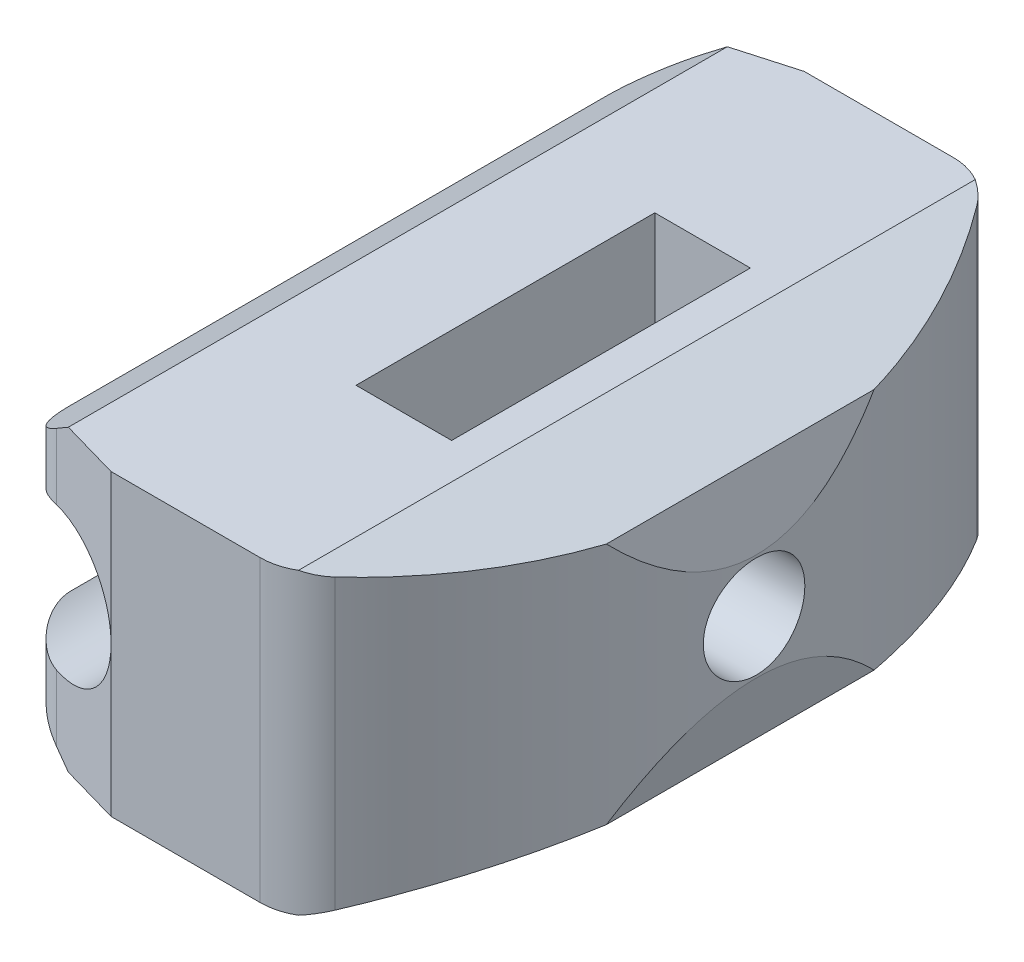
ISO-10303-21;
HEADER;
FILE_DESCRIPTION(('STEP AP214'),'2;1');
FILE_NAME('part.step','',(''),(''),'','','');
FILE_SCHEMA(('AUTOMOTIVE_DESIGN { 1 0 10303 214 1 1 1 1 }'));
ENDSEC;
DATA;
#1=APPLICATION_CONTEXT('core data for automotive mechanical design processes');
#2=APPLICATION_PROTOCOL_DEFINITION('international standard','automotive_design',2000,#1);
#3=PRODUCT_CONTEXT('',#1,'mechanical');
#4=PRODUCT('Part','Part','',(#3));
#5=PRODUCT_RELATED_PRODUCT_CATEGORY('part','',(#4));
#6=PRODUCT_DEFINITION_FORMATION('','',#4);
#7=PRODUCT_DEFINITION_CONTEXT('part definition',#1,'design');
#8=PRODUCT_DEFINITION('design','',#6,#7);
#9=PRODUCT_DEFINITION_SHAPE('','',#8);
#10=(LENGTH_UNIT() NAMED_UNIT(*) SI_UNIT(.MILLI.,.METRE.));
#11=(NAMED_UNIT(*) PLANE_ANGLE_UNIT() SI_UNIT($,.RADIAN.));
#12=(NAMED_UNIT(*) SI_UNIT($,.STERADIAN.) SOLID_ANGLE_UNIT());
#13=UNCERTAINTY_MEASURE_WITH_UNIT(LENGTH_MEASURE(1.E-05),#10,'distance_accuracy_value','');
#14=(GEOMETRIC_REPRESENTATION_CONTEXT(3) GLOBAL_UNCERTAINTY_ASSIGNED_CONTEXT((#13)) GLOBAL_UNIT_ASSIGNED_CONTEXT((#10,
#11,#12)) REPRESENTATION_CONTEXT('',''));
#15=CARTESIAN_POINT('',(0.,0.,0.));
#16=DIRECTION('',(0.,0.,1.));
#17=DIRECTION('',(1.,0.,0.));
#18=AXIS2_PLACEMENT_3D('',#15,#16,#17);
#19=CARTESIAN_POINT('',(5.,3.507651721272,-58.));
#20=DIRECTION('',(1.,0.,0.));
#21=DIRECTION('',(0.,0.,-1.));
#22=AXIS2_PLACEMENT_3D('',#19,#20,#21);
#23=PLANE('',#22);
#24=DIRECTION('',(0.,-1.,0.));
#25=VECTOR('',#24,1.);
#26=CARTESIAN_POINT('',(5.00000000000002,58.,-51.374386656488));
#27=LINE('',#26,#25);
#28=CARTESIAN_POINT('',(5.00000000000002,8.02786404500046,-51.374386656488));
#29=VERTEX_POINT('',#28);
#30=CARTESIAN_POINT('',(5.00000000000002,3.50765172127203,-51.374386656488));
#31=VERTEX_POINT('',#30);
#32=EDGE_CURVE('E802',#29,#31,#27,.T.);
#33=ORIENTED_EDGE('',*,*,#32,.T.);
#34=DIRECTION('',(0.,0.,1.));
#35=VECTOR('',#34,1.);
#36=CARTESIAN_POINT('',(5.,3.507651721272,-58.));
#37=LINE('',#36,#35);
#38=CARTESIAN_POINT('',(5.,3.50765172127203,-6.62561334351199));
#39=VERTEX_POINT('',#38);
#40=EDGE_CURVE('E283',#31,#39,#37,.T.);
#41=ORIENTED_EDGE('',*,*,#40,.T.);
#42=DIRECTION('',(0.,-1.,0.));
#43=VECTOR('',#42,1.);
#44=CARTESIAN_POINT('',(5.,58.,-6.62561334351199));
#45=LINE('',#44,#43);
#46=CARTESIAN_POINT('',(5.,8.02786404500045,-6.62561334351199));
#47=VERTEX_POINT('',#46);
#48=EDGE_CURVE('E798',#47,#39,#45,.T.);
#49=ORIENTED_EDGE('',*,*,#48,.F.);
#50=DIRECTION('',(0.,0.,1.));
#51=VECTOR('',#50,1.);
#52=CARTESIAN_POINT('',(5.,8.0278640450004,-58.));
#53=LINE('',#52,#51);
#54=EDGE_CURVE('E287',#29,#47,#53,.T.);
#55=ORIENTED_EDGE('',*,*,#54,.F.);
#56=EDGE_LOOP('',(#33,#41,#49,#55));
#57=FACE_BOUND('',#56,.T.);
#58=ADVANCED_FACE('F41',(#57),#23,.F.);
#59=CARTESIAN_POINT('',(5.,16.9721359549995,-58.));
#60=DIRECTION('',(1.,0.,0.));
#61=DIRECTION('',(0.,0.,-1.));
#62=AXIS2_PLACEMENT_3D('',#59,#60,#61);
#63=PLANE('',#62);
#64=DIRECTION('',(0.,-1.,0.));
#65=VECTOR('',#64,1.);
#66=CARTESIAN_POINT('',(5.00000000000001,58.,-51.374386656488));
#67=LINE('',#66,#65);
#68=CARTESIAN_POINT('',(5.00000000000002,16.9721359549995,-51.374386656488));
#69=VERTEX_POINT('',#68);
#70=CARTESIAN_POINT('',(5.00000000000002,21.492348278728,-51.374386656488));
#71=VERTEX_POINT('',#70);
#72=EDGE_CURVE('E309',#69,#71,#67,.F.);
#73=ORIENTED_EDGE('',*,*,#72,.F.);
#74=DIRECTION('',(0.,0.,1.));
#75=VECTOR('',#74,1.);
#76=CARTESIAN_POINT('',(4.99999999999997,16.9721359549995,-58.));
#77=LINE('',#76,#75);
#78=CARTESIAN_POINT('',(5.,16.9721359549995,-6.62561334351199));
#79=VERTEX_POINT('',#78);
#80=EDGE_CURVE('E291',#69,#79,#77,.T.);
#81=ORIENTED_EDGE('',*,*,#80,.T.);
#82=DIRECTION('',(0.,-1.,0.));
#83=VECTOR('',#82,1.);
#84=CARTESIAN_POINT('',(5.00000000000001,58.,-6.62561334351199));
#85=LINE('',#84,#83);
#86=CARTESIAN_POINT('',(5.,21.492348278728,-6.62561334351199));
#87=VERTEX_POINT('',#86);
#88=EDGE_CURVE('E220',#79,#87,#85,.F.);
#89=ORIENTED_EDGE('',*,*,#88,.T.);
#90=DIRECTION('',(0.,0.,1.));
#91=VECTOR('',#90,1.);
#92=CARTESIAN_POINT('',(5.,21.492348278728,-58.));
#93=LINE('',#92,#91);
#94=EDGE_CURVE('E248',#71,#87,#93,.T.);
#95=ORIENTED_EDGE('',*,*,#94,.F.);
#96=EDGE_LOOP('',(#73,#81,#89,#95));
#97=FACE_BOUND('',#96,.T.);
#98=ADVANCED_FACE('F503',(#97),#63,.F.);
#99=CARTESIAN_POINT('',(9.,12.5,-58.));
#100=DIRECTION('',(0.,0.,1.));
#101=DIRECTION('',(1.,0.,0.));
#102=AXIS2_PLACEMENT_3D('',#99,#100,#101);
#103=PLANE('',#102);
#104=DIRECTION('',(-1.,0.,0.));
#105=VECTOR('',#104,1.);
#106=CARTESIAN_POINT('',(30.,0.,-58.));
#107=LINE('',#106,#105);
#108=CARTESIAN_POINT('',(27.478285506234,0.,-58.));
#109=VERTEX_POINT('',#108);
#110=CARTESIAN_POINT('',(15.,0.,-58.));
#111=VERTEX_POINT('',#110);
#112=EDGE_CURVE('E229',#109,#111,#107,.T.);
#113=ORIENTED_EDGE('',*,*,#112,.T.);
#114=DIRECTION('',(0.,1.,0.));
#115=VECTOR('',#114,1.);
#116=CARTESIAN_POINT('',(15.,12.5,-58.));
#117=LINE('',#116,#115);
#118=CARTESIAN_POINT('',(15.,12.5,-58.));
#119=VERTEX_POINT('',#118);
#120=EDGE_CURVE('E208',#111,#119,#117,.T.);
#121=ORIENTED_EDGE('',*,*,#120,.T.);
#122=CARTESIAN_POINT('',(15.,25.,-58.));
#123=VERTEX_POINT('',#122);
#124=EDGE_CURVE('E221',#119,#123,#117,.T.);
#125=ORIENTED_EDGE('',*,*,#124,.T.);
#126=DIRECTION('',(1.,0.,0.));
#127=VECTOR('',#126,1.);
#128=CARTESIAN_POINT('',(10.,25.,-58.));
#129=LINE('',#128,#127);
#130=CARTESIAN_POINT('',(27.478285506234,25.,-58.));
#131=VERTEX_POINT('',#130);
#132=EDGE_CURVE('E242',#123,#131,#129,.T.);
#133=ORIENTED_EDGE('',*,*,#132,.T.);
#134=DIRECTION('',(0.,-1.,0.));
#135=VECTOR('',#134,1.);
#136=CARTESIAN_POINT('',(27.478285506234,58.,-58.));
#137=LINE('',#136,#135);
#138=EDGE_CURVE('E240',#109,#131,#137,.F.);
#139=ORIENTED_EDGE('',*,*,#138,.F.);
#140=EDGE_LOOP('',(#113,#121,#125,#133,#139));
#141=FACE_BOUND('',#140,.T.);
#142=ADVANCED_FACE('F238',(#141),#103,.F.);
#143=CARTESIAN_POINT('',(9.,12.5,0.));
#144=DIRECTION('',(0.,0.,1.));
#145=DIRECTION('',(1.,0.,0.));
#146=AXIS2_PLACEMENT_3D('',#143,#144,#145);
#147=PLANE('',#146);
#148=DIRECTION('',(0.,1.,0.));
#149=VECTOR('',#148,1.);
#150=CARTESIAN_POINT('',(15.,12.5,0.));
#151=LINE('',#150,#149);
#152=CARTESIAN_POINT('',(15.,0.,0.));
#153=VERTEX_POINT('',#152);
#154=CARTESIAN_POINT('',(15.,12.5,0.));
#155=VERTEX_POINT('',#154);
#156=EDGE_CURVE('E303',#153,#155,#151,.T.);
#157=ORIENTED_EDGE('',*,*,#156,.F.);
#158=DIRECTION('',(-1.,0.,0.));
#159=VECTOR('',#158,1.);
#160=CARTESIAN_POINT('',(30.,0.,0.));
#161=LINE('',#160,#159);
#162=CARTESIAN_POINT('',(27.478285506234,0.,0.));
#163=VERTEX_POINT('',#162);
#164=EDGE_CURVE('E252',#163,#153,#161,.T.);
#165=ORIENTED_EDGE('',*,*,#164,.F.);
#166=DIRECTION('',(0.,-1.,0.));
#167=VECTOR('',#166,1.);
#168=CARTESIAN_POINT('',(27.478285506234,58.,0.));
#169=LINE('',#168,#167);
#170=CARTESIAN_POINT('',(27.478285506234,25.,0.));
#171=VERTEX_POINT('',#170);
#172=EDGE_CURVE('E264',#163,#171,#169,.F.);
#173=ORIENTED_EDGE('',*,*,#172,.T.);
#174=DIRECTION('',(1.,0.,0.));
#175=VECTOR('',#174,1.);
#176=CARTESIAN_POINT('',(10.,25.,0.));
#177=LINE('',#176,#175);
#178=CARTESIAN_POINT('',(15.,25.,0.));
#179=VERTEX_POINT('',#178);
#180=EDGE_CURVE('E243',#179,#171,#177,.T.);
#181=ORIENTED_EDGE('',*,*,#180,.F.);
#182=EDGE_CURVE('E300',#155,#179,#151,.T.);
#183=ORIENTED_EDGE('',*,*,#182,.F.);
#184=EDGE_LOOP('',(#157,#165,#173,#181,#183));
#185=FACE_BOUND('',#184,.T.);
#186=ADVANCED_FACE('F533',(#185),#147,.T.);
#187=CARTESIAN_POINT('',(10.,25.,-58.));
#188=DIRECTION('',(0.,-1.,0.));
#189=DIRECTION('',(0.,0.,-1.));
#190=AXIS2_PLACEMENT_3D('',#187,#188,#189);
#191=PLANE('',#190);
#192=ORIENTED_EDGE('',*,*,#132,.F.);
#193=DIRECTION('',(-0.961644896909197,0.,0.274297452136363));
#194=VECTOR('',#193,1.);
#195=CARTESIAN_POINT('',(10.3761954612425,25.,-56.6811162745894));
#196=LINE('',#195,#194);
#197=CARTESIAN_POINT('',(10.,25.,-56.573811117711));
#198=VERTEX_POINT('',#197);
#199=EDGE_CURVE('E57',#123,#198,#196,.T.);
#200=ORIENTED_EDGE('',*,*,#199,.T.);
#201=DIRECTION('',(0.,0.,1.));
#202=VECTOR('',#201,1.);
#203=CARTESIAN_POINT('',(10.,25.,-58.));
#204=LINE('',#203,#202);
#205=CARTESIAN_POINT('',(10.,25.,-1.42618888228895));
#206=VERTEX_POINT('',#205);
#207=EDGE_CURVE('E261',#198,#206,#204,.T.);
#208=ORIENTED_EDGE('',*,*,#207,.T.);
#209=DIRECTION('',(0.961644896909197,0.,0.274297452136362));
#210=VECTOR('',#209,1.);
#211=CARTESIAN_POINT('',(-4.92285575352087,25.,-5.68275107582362));
#212=LINE('',#211,#210);
#213=EDGE_CURVE('E342',#206,#179,#212,.T.);
#214=ORIENTED_EDGE('',*,*,#213,.T.);
#215=ORIENTED_EDGE('',*,*,#180,.T.);
#216=CARTESIAN_POINT('',(27.478285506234,25.,-5.));
#217=DIRECTION('',(0.,-1.,0.));
#218=DIRECTION('',(0.,0.,-1.));
#219=AXIS2_PLACEMENT_3D('',#216,#217,#218);
#220=CIRCLE('',#219,5.00000000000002);
#221=CARTESIAN_POINT('',(30.,25.,-0.682482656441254));
#222=VERTEX_POINT('',#221);
#223=EDGE_CURVE('E65',#171,#222,#220,.F.);
#224=ORIENTED_EDGE('',*,*,#223,.T.);
#225=DIRECTION('',(0.,0.,1.));
#226=VECTOR('',#225,1.);
#227=CARTESIAN_POINT('',(30.,25.,-58.));
#228=LINE('',#227,#226);
#229=CARTESIAN_POINT('',(30.,25.,-57.3175173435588));
#230=VERTEX_POINT('',#229);
#231=EDGE_CURVE('E265',#230,#222,#228,.T.);
#232=ORIENTED_EDGE('',*,*,#231,.F.);
#233=CARTESIAN_POINT('',(27.478285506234,25.,-53.));
#234=DIRECTION('',(0.,-1.,0.));
#235=DIRECTION('',(0.,0.,-1.));
#236=AXIS2_PLACEMENT_3D('',#233,#234,#235);
#237=CIRCLE('',#236,5.00000000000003);
#238=EDGE_CURVE('E345',#230,#131,#237,.F.);
#239=ORIENTED_EDGE('',*,*,#238,.T.);
#240=EDGE_LOOP('',(#192,#200,#208,#214,#215,#224,#232,#239));
#241=FACE_BOUND('',#240,.T.);
#242=DIRECTION('',(-1.,0.,0.));
#243=VECTOR('',#242,1.);
#244=CARTESIAN_POINT('',(10.,25.,-41.5));
#245=LINE('',#244,#243);
#246=CARTESIAN_POINT('',(27.,25.,-41.5));
#247=VERTEX_POINT('',#246);
#248=CARTESIAN_POINT('',(19.,25.,-41.5));
#249=VERTEX_POINT('',#248);
#250=EDGE_CURVE('E255',#247,#249,#245,.T.);
#251=ORIENTED_EDGE('',*,*,#250,.F.);
#252=DIRECTION('',(0.,0.,-1.));
#253=VECTOR('',#252,1.);
#254=CARTESIAN_POINT('',(27.,25.,-58.));
#255=LINE('',#254,#253);
#256=CARTESIAN_POINT('',(27.,25.,-16.5));
#257=VERTEX_POINT('',#256);
#258=EDGE_CURVE('E462',#257,#247,#255,.T.);
#259=ORIENTED_EDGE('',*,*,#258,.F.);
#260=DIRECTION('',(1.,0.,0.));
#261=VECTOR('',#260,1.);
#262=CARTESIAN_POINT('',(10.,25.,-16.5));
#263=LINE('',#262,#261);
#264=CARTESIAN_POINT('',(19.,25.,-16.5));
#265=VERTEX_POINT('',#264);
#266=EDGE_CURVE('E465',#265,#257,#263,.T.);
#267=ORIENTED_EDGE('',*,*,#266,.F.);
#268=DIRECTION('',(0.,0.,1.));
#269=VECTOR('',#268,1.);
#270=CARTESIAN_POINT('',(19.,25.,-58.));
#271=LINE('',#270,#269);
#272=EDGE_CURVE('E468',#249,#265,#271,.T.);
#273=ORIENTED_EDGE('',*,*,#272,.F.);
#274=EDGE_LOOP('',(#251,#259,#267,#273));
#275=FACE_BOUND('',#274,.T.);
#276=ADVANCED_FACE('F485',(#241,#275),#191,.F.);
#277=CARTESIAN_POINT('',(30.,0.,-58.));
#278=DIRECTION('',(0.,1.,0.));
#279=DIRECTION('',(0.,0.,1.));
#280=AXIS2_PLACEMENT_3D('',#277,#278,#279);
#281=PLANE('',#280);
#282=DIRECTION('',(0.,0.,1.));
#283=VECTOR('',#282,1.);
#284=CARTESIAN_POINT('',(10.,0.,-58.));
#285=LINE('',#284,#283);
#286=CARTESIAN_POINT('',(10.,0.,-56.573811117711));
#287=VERTEX_POINT('',#286);
#288=CARTESIAN_POINT('',(10.,0.,-1.42618888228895));
#289=VERTEX_POINT('',#288);
#290=EDGE_CURVE('E232',#287,#289,#285,.T.);
#291=ORIENTED_EDGE('',*,*,#290,.F.);
#292=DIRECTION('',(-0.961644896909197,0.,0.274297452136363));
#293=VECTOR('',#292,1.);
#294=CARTESIAN_POINT('',(15.,0.,-58.));
#295=LINE('',#294,#293);
#296=EDGE_CURVE('E212',#111,#287,#295,.T.);
#297=ORIENTED_EDGE('',*,*,#296,.F.);
#298=ORIENTED_EDGE('',*,*,#112,.F.);
#299=CARTESIAN_POINT('',(27.478285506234,0.,-53.));
#300=DIRECTION('',(0.,1.,0.));
#301=DIRECTION('',(0.,0.,1.));
#302=AXIS2_PLACEMENT_3D('',#299,#300,#301);
#303=CIRCLE('',#302,5.00000000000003);
#304=CARTESIAN_POINT('',(30.,0.,-57.3175173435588));
#305=VERTEX_POINT('',#304);
#306=EDGE_CURVE('E337',#305,#109,#303,.T.);
#307=ORIENTED_EDGE('',*,*,#306,.F.);
#308=DIRECTION('',(0.,0.,1.));
#309=VECTOR('',#308,1.);
#310=CARTESIAN_POINT('',(30.,0.,-58.));
#311=LINE('',#310,#309);
#312=CARTESIAN_POINT('',(30.,0.,-0.682482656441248));
#313=VERTEX_POINT('',#312);
#314=EDGE_CURVE('E277',#305,#313,#311,.T.);
#315=ORIENTED_EDGE('',*,*,#314,.T.);
#316=CARTESIAN_POINT('',(27.478285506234,0.,-5.));
#317=DIRECTION('',(0.,1.,0.));
#318=DIRECTION('',(0.,0.,1.));
#319=AXIS2_PLACEMENT_3D('',#316,#317,#318);
#320=CIRCLE('',#319,5.00000000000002);
#321=EDGE_CURVE('E847',#163,#313,#320,.T.);
#322=ORIENTED_EDGE('',*,*,#321,.F.);
#323=ORIENTED_EDGE('',*,*,#164,.T.);
#324=DIRECTION('',(0.961644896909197,0.,0.274297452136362));
#325=VECTOR('',#324,1.);
#326=CARTESIAN_POINT('',(15.,0.,0.));
#327=LINE('',#326,#325);
#328=EDGE_CURVE('E234',#289,#153,#327,.T.);
#329=ORIENTED_EDGE('',*,*,#328,.F.);
#330=EDGE_LOOP('',(#291,#297,#298,#307,#315,#322,#323,#329));
#331=FACE_BOUND('',#330,.T.);
#332=DIRECTION('',(-1.,0.,0.));
#333=VECTOR('',#332,1.);
#334=CARTESIAN_POINT('',(27.,0.,-41.5));
#335=LINE('',#334,#333);
#336=CARTESIAN_POINT('',(27.,0.,-41.5));
#337=VERTEX_POINT('',#336);
#338=CARTESIAN_POINT('',(19.,0.,-41.5));
#339=VERTEX_POINT('',#338);
#340=EDGE_CURVE('E433',#337,#339,#335,.T.);
#341=ORIENTED_EDGE('',*,*,#340,.T.);
#342=DIRECTION('',(0.,0.,1.));
#343=VECTOR('',#342,1.);
#344=CARTESIAN_POINT('',(19.,0.,-41.5));
#345=LINE('',#344,#343);
#346=CARTESIAN_POINT('',(19.,0.,-16.5));
#347=VERTEX_POINT('',#346);
#348=EDGE_CURVE('E437',#339,#347,#345,.T.);
#349=ORIENTED_EDGE('',*,*,#348,.T.);
#350=DIRECTION('',(1.,0.,0.));
#351=VECTOR('',#350,1.);
#352=CARTESIAN_POINT('',(19.,0.,-16.5));
#353=LINE('',#352,#351);
#354=CARTESIAN_POINT('',(27.,0.,-16.5));
#355=VERTEX_POINT('',#354);
#356=EDGE_CURVE('E441',#347,#355,#353,.T.);
#357=ORIENTED_EDGE('',*,*,#356,.T.);
#358=DIRECTION('',(0.,0.,-1.));
#359=VECTOR('',#358,1.);
#360=CARTESIAN_POINT('',(27.,0.,-16.5));
#361=LINE('',#360,#359);
#362=EDGE_CURVE('E445',#355,#337,#361,.T.);
#363=ORIENTED_EDGE('',*,*,#362,.T.);
#364=EDGE_LOOP('',(#341,#349,#357,#363));
#365=FACE_BOUND('',#364,.T.);
#366=ADVANCED_FACE('F226',(#331,#365),#281,.F.);
#367=CARTESIAN_POINT('',(10.,25.,-58.));
#368=DIRECTION('',(-0.574302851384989,0.81864292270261,0.));
#369=DIRECTION('',(-0.81864292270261,-0.574302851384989,0.));
#370=AXIS2_PLACEMENT_3D('',#367,#368,#369);
#371=PLANE('',#370);
#372=DIRECTION('',(0.797197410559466,0.559258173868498,-0.227390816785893));
#373=VECTOR('',#372,1.);
#374=CARTESIAN_POINT('',(10.2585329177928,25.1813686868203,-56.6475544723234));
#375=LINE('',#374,#373);
#376=CARTESIAN_POINT('',(8.62851273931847,24.0378600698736,-56.182611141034));
#377=VERTEX_POINT('',#376);
#378=EDGE_CURVE('E361',#377,#198,#375,.T.);
#379=ORIENTED_EDGE('',*,*,#378,.F.);
#380=CARTESIAN_POINT('',(10.,25.,-51.374386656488));
#381=DIRECTION('',(-0.574302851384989,0.81864292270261,0.));
#382=DIRECTION('',(-0.81864292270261,-0.574302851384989,0.));
#383=AXIS2_PLACEMENT_3D('',#380,#381,#382);
#384=ELLIPSE('',#383,6.107668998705,4.99999999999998);
#385=EDGE_CURVE('E421',#71,#377,#384,.F.);
#386=ORIENTED_EDGE('',*,*,#385,.F.);
#387=ORIENTED_EDGE('',*,*,#94,.T.);
#388=CARTESIAN_POINT('',(10.,25.,-6.62561334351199));
#389=DIRECTION('',(-0.574302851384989,0.81864292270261,0.));
#390=DIRECTION('',(-0.81864292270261,-0.574302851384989,0.));
#391=AXIS2_PLACEMENT_3D('',#388,#389,#390);
#392=ELLIPSE('',#391,6.10766899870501,4.99999999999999);
#393=CARTESIAN_POINT('',(8.62851273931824,24.0378600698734,-1.817388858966));
#394=VERTEX_POINT('',#393);
#395=EDGE_CURVE('E779',#394,#87,#392,.F.);
#396=ORIENTED_EDGE('',*,*,#395,.F.);
#397=DIRECTION('',(-0.797197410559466,-0.559258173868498,-0.227390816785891));
#398=VECTOR('',#397,1.);
#399=CARTESIAN_POINT('',(-0.255438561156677,17.8054986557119,-4.35142737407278));
#400=LINE('',#399,#398);
#401=EDGE_CURVE('E349',#206,#394,#400,.T.);
#402=ORIENTED_EDGE('',*,*,#401,.F.);
#403=ORIENTED_EDGE('',*,*,#207,.F.);
#404=EDGE_LOOP('',(#379,#386,#387,#396,#402,#403));
#405=FACE_BOUND('',#404,.T.);
#406=ADVANCED_FACE('F43',(#405),#371,.T.);
#407=CARTESIAN_POINT('',(30.,25.,-58.));
#408=DIRECTION('',(-0.260224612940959,-0.965548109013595,0.));
#409=DIRECTION('',(0.965548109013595,-0.260224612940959,0.));
#410=AXIS2_PLACEMENT_3D('',#407,#408,#409);
#411=PLANE('',#410);
#412=ORIENTED_EDGE('',*,*,#231,.T.);
#413=CARTESIAN_POINT('',(27.478285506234,25.6796265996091,-5.));
#414=DIRECTION('',(-0.260224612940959,-0.965548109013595,0.));
#415=DIRECTION('',(0.965548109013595,-0.260224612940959,0.));
#416=AXIS2_PLACEMENT_3D('',#413,#414,#415);
#417=ELLIPSE('',#416,5.17840587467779,5.00000000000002);
#418=CARTESIAN_POINT('',(31.5839080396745,24.5731213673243,-2.14625445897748));
#419=VERTEX_POINT('',#418);
#420=EDGE_CURVE('E816',#222,#419,#417,.F.);
#421=ORIENTED_EDGE('',*,*,#420,.T.);
#422=CARTESIAN_POINT('',(-7.05000000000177,34.9853356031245,-29.));
#423=DIRECTION('',(-0.260224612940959,-0.965548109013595,0.));
#424=DIRECTION('',(0.965548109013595,-0.260224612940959,0.));
#425=AXIS2_PLACEMENT_3D('',#422,#423,#424);
#426=ELLIPSE('',#425,48.7287992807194,47.0500000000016);
#427=CARTESIAN_POINT('',(38.6475566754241,22.6693993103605,-17.8001868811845));
#428=VERTEX_POINT('',#427);
#429=EDGE_CURVE('E427',#419,#428,#426,.F.);
#430=ORIENTED_EDGE('',*,*,#429,.T.);
#431=DIRECTION('',(0.,0.,1.));
#432=VECTOR('',#431,1.);
#433=CARTESIAN_POINT('',(38.6475566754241,22.6693993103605,-58.));
#434=LINE('',#433,#432);
#435=CARTESIAN_POINT('',(38.6475566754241,22.6693993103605,-40.1998131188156));
#436=VERTEX_POINT('',#435);
#437=EDGE_CURVE('E269',#436,#428,#434,.T.);
#438=ORIENTED_EDGE('',*,*,#437,.F.);
#439=CARTESIAN_POINT('',(31.5839080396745,24.5731213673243,-55.8537455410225));
#440=VERTEX_POINT('',#439);
#441=EDGE_CURVE('E428',#436,#440,#426,.F.);
#442=ORIENTED_EDGE('',*,*,#441,.T.);
#443=CARTESIAN_POINT('',(27.478285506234,25.6796265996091,-53.));
#444=DIRECTION('',(-0.260224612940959,-0.965548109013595,0.));
#445=DIRECTION('',(0.965548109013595,-0.260224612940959,0.));
#446=AXIS2_PLACEMENT_3D('',#443,#444,#445);
#447=ELLIPSE('',#446,5.17840587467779,5.00000000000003);
#448=EDGE_CURVE('E334',#440,#230,#447,.F.);
#449=ORIENTED_EDGE('',*,*,#448,.T.);
#450=EDGE_LOOP('',(#412,#421,#430,#438,#442,#449));
#451=FACE_BOUND('',#450,.T.);
#452=ADVANCED_FACE('F526',(#451),#411,.F.);
#453=CARTESIAN_POINT('',(39.9999999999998,16.9575563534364,-58.));
#454=DIRECTION('',(0.973094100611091,0.230408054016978,0.));
#455=DIRECTION('',(-0.230408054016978,0.973094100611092,0.));
#456=AXIS2_PLACEMENT_3D('',#453,#454,#455);
#457=PLANE('',#456);
#458=ORIENTED_EDGE('',*,*,#437,.T.);
#459=CARTESIAN_POINT('',(-7.05000000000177,215.66622402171,-29.));
#460=DIRECTION('',(0.973094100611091,0.230408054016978,0.));
#461=DIRECTION('',(0.230408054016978,-0.973094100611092,0.));
#462=AXIS2_PLACEMENT_3D('',#459,#460,#461);
#463=ELLIPSE('',#462,204.202931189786,47.0500000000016);
#464=EDGE_CURVE('E424',#436,#428,#463,.F.);
#465=ORIENTED_EDGE('',*,*,#464,.F.);
#466=EDGE_LOOP('',(#458,#465));
#467=FACE_BOUND('',#466,.T.);
#468=ADVANCED_FACE('F522',(#467),#457,.T.);
#469=CARTESIAN_POINT('',(39.9999999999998,8.04244364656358,-58.));
#470=DIRECTION('',(-0.973094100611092,0.230408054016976,0.));
#471=DIRECTION('',(-0.230408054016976,-0.973094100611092,0.));
#472=AXIS2_PLACEMENT_3D('',#469,#470,#471);
#473=PLANE('',#472);
#474=DIRECTION('',(0.,0.,1.));
#475=VECTOR('',#474,1.);
#476=CARTESIAN_POINT('',(38.6475566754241,2.33060068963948,-58.));
#477=LINE('',#476,#475);
#478=CARTESIAN_POINT('',(38.6475566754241,2.33060068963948,-40.1998131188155));
#479=VERTEX_POINT('',#478);
#480=CARTESIAN_POINT('',(38.6475566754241,2.33060068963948,-17.8001868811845));
#481=VERTEX_POINT('',#480);
#482=EDGE_CURVE('E273',#479,#481,#477,.T.);
#483=ORIENTED_EDGE('',*,*,#482,.F.);
#484=CARTESIAN_POINT('',(-7.05000000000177,-190.666224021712,-29.));
#485=DIRECTION('',(-0.973094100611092,0.230408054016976,0.));
#486=DIRECTION('',(-0.230408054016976,-0.973094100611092,0.));
#487=AXIS2_PLACEMENT_3D('',#484,#485,#486);
#488=ELLIPSE('',#487,204.202931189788,47.0500000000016);
#489=EDGE_CURVE('E326',#479,#481,#488,.F.);
#490=ORIENTED_EDGE('',*,*,#489,.T.);
#491=EDGE_LOOP('',(#483,#490));
#492=FACE_BOUND('',#491,.T.);
#493=ADVANCED_FACE('F519',(#492),#473,.F.);
#494=CARTESIAN_POINT('',(30.,0.,-58.));
#495=DIRECTION('',(0.260224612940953,-0.965548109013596,0.));
#496=DIRECTION('',(0.965548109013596,0.260224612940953,0.));
#497=AXIS2_PLACEMENT_3D('',#494,#495,#496);
#498=PLANE('',#497);
#499=CARTESIAN_POINT('',(27.478285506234,-0.679626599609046,-5.));
#500=DIRECTION('',(0.260224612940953,-0.965548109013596,0.));
#501=DIRECTION('',(-0.965548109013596,-0.260224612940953,0.));
#502=AXIS2_PLACEMENT_3D('',#499,#500,#501);
#503=ELLIPSE('',#502,5.17840587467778,5.00000000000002);
#504=CARTESIAN_POINT('',(31.5839080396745,0.426878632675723,-2.14625445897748));
#505=VERTEX_POINT('',#504);
#506=EDGE_CURVE('E774',#313,#505,#503,.F.);
#507=ORIENTED_EDGE('',*,*,#506,.F.);
#508=ORIENTED_EDGE('',*,*,#314,.F.);
#509=CARTESIAN_POINT('',(27.478285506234,-0.679626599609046,-53.));
#510=DIRECTION('',(0.260224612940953,-0.965548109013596,0.));
#511=DIRECTION('',(-0.965548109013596,-0.260224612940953,0.));
#512=AXIS2_PLACEMENT_3D('',#509,#510,#511);
#513=ELLIPSE('',#512,5.17840587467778,5.00000000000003);
#514=CARTESIAN_POINT('',(31.5839080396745,0.426878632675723,-55.8537455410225));
#515=VERTEX_POINT('',#514);
#516=EDGE_CURVE('E332',#515,#305,#513,.F.);
#517=ORIENTED_EDGE('',*,*,#516,.F.);
#518=CARTESIAN_POINT('',(-7.05000000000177,-9.98533560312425,-29.));
#519=DIRECTION('',(0.260224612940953,-0.965548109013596,0.));
#520=DIRECTION('',(-0.965548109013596,-0.260224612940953,0.));
#521=AXIS2_PLACEMENT_3D('',#518,#519,#520);
#522=ELLIPSE('',#521,48.7287992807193,47.0500000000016);
#523=EDGE_CURVE('E45',#479,#515,#522,.F.);
#524=ORIENTED_EDGE('',*,*,#523,.F.);
#525=ORIENTED_EDGE('',*,*,#482,.T.);
#526=EDGE_CURVE('E12',#505,#481,#522,.F.);
#527=ORIENTED_EDGE('',*,*,#526,.F.);
#528=EDGE_LOOP('',(#507,#508,#517,#524,#525,#527));
#529=FACE_BOUND('',#528,.T.);
#530=ADVANCED_FACE('F341',(#529),#498,.T.);
#531=CARTESIAN_POINT('',(10.,0.,-58.));
#532=DIRECTION('',(0.57430285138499,0.81864292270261,0.));
#533=DIRECTION('',(-0.818642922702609,0.574302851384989,0.));
#534=AXIS2_PLACEMENT_3D('',#531,#532,#533);
#535=PLANE('',#534);
#536=CARTESIAN_POINT('',(10.,0.,-51.374386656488));
#537=DIRECTION('',(0.57430285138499,0.81864292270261,0.));
#538=DIRECTION('',(0.818642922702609,-0.574302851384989,0.));
#539=AXIS2_PLACEMENT_3D('',#536,#537,#538);
#540=ELLIPSE('',#539,6.107668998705,4.99999999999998);
#541=CARTESIAN_POINT('',(8.62851273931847,0.962139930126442,-56.182611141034));
#542=VERTEX_POINT('',#541);
#543=EDGE_CURVE('E417',#31,#542,#540,.F.);
#544=ORIENTED_EDGE('',*,*,#543,.T.);
#545=DIRECTION('',(0.797197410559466,-0.559258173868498,-0.227390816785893));
#546=VECTOR('',#545,1.);
#547=CARTESIAN_POINT('',(10.2585329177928,-0.181368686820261,-56.6475544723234));
#548=LINE('',#547,#546);
#549=EDGE_CURVE('E358',#542,#287,#548,.T.);
#550=ORIENTED_EDGE('',*,*,#549,.T.);
#551=ORIENTED_EDGE('',*,*,#290,.T.);
#552=DIRECTION('',(-0.797197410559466,0.559258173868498,-0.227390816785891));
#553=VECTOR('',#552,1.);
#554=CARTESIAN_POINT('',(-0.255438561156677,7.19450134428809,-4.35142737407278));
#555=LINE('',#554,#553);
#556=CARTESIAN_POINT('',(8.62851273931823,0.96213993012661,-1.817388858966));
#557=VERTEX_POINT('',#556);
#558=EDGE_CURVE('E824',#289,#557,#555,.T.);
#559=ORIENTED_EDGE('',*,*,#558,.T.);
#560=CARTESIAN_POINT('',(10.,0.,-6.62561334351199));
#561=DIRECTION('',(0.57430285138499,0.81864292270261,0.));
#562=DIRECTION('',(0.818642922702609,-0.574302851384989,0.));
#563=AXIS2_PLACEMENT_3D('',#560,#561,#562);
#564=ELLIPSE('',#563,6.10766899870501,4.99999999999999);
#565=EDGE_CURVE('E782',#557,#39,#564,.F.);
#566=ORIENTED_EDGE('',*,*,#565,.T.);
#567=ORIENTED_EDGE('',*,*,#40,.F.);
#568=EDGE_LOOP('',(#544,#550,#551,#559,#566,#567));
#569=FACE_BOUND('',#568,.T.);
#570=ADVANCED_FACE('F511',(#569),#535,.F.);
#571=CARTESIAN_POINT('',(9.,12.5,-58.));
#572=DIRECTION('',(0.,0.,1.));
#573=DIRECTION('',(1.,0.,0.));
#574=AXIS2_PLACEMENT_3D('',#571,#572,#573);
#575=CYLINDRICAL_SURFACE('',#574,5.99999999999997);
#576=CARTESIAN_POINT('',(9.,12.5,-56.2885733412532));
#577=DIRECTION('',(0.274297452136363,0.,0.961644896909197));
#578=DIRECTION('',(-0.961644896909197,0.,0.274297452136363));
#579=AXIS2_PLACEMENT_3D('',#576,#577,#578);
#580=ELLIPSE('',#579,6.23930935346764,5.99999999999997);
#581=CARTESIAN_POINT('',(8.62851273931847,6.51151127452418,-56.182611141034));
#582=VERTEX_POINT('',#581);
#583=EDGE_CURVE('E215',#119,#582,#580,.F.);
#584=ORIENTED_EDGE('',*,*,#583,.T.);
#585=CARTESIAN_POINT('',(8.62851273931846,6.51151127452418,-56.1826111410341));
#586=CARTESIAN_POINT('',(8.50232624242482,6.51931361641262,-56.1466442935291));
#587=CARTESIAN_POINT('',(8.37785560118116,6.53106276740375,-56.1057446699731));
#588=CARTESIAN_POINT('',(8.13339300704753,6.56164452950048,-56.0147208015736));
#589=CARTESIAN_POINT('',(8.01339591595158,6.58046872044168,-55.9646075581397));
#590=CARTESIAN_POINT('',(7.77958224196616,6.62423326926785,-55.8561538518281));
#591=CARTESIAN_POINT('',(7.66572319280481,6.64912243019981,-55.7978839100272));
#592=CARTESIAN_POINT('',(7.44375800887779,6.7042084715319,-55.6734363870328));
#593=CARTESIAN_POINT('',(7.33565348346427,6.73440682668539,-55.6072566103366));
#594=CARTESIAN_POINT('',(7.0217416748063,6.83129478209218,-55.3984250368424));
#595=CARTESIAN_POINT('',(6.82506611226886,6.90453248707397,-55.244883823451));
#596=CARTESIAN_POINT('',(6.45830826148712,7.06127323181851,-54.9124616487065));
#597=CARTESIAN_POINT('',(6.28830532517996,7.14480562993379,-54.7335079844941));
#598=CARTESIAN_POINT('',(6.04416774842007,7.27762460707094,-54.435570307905));
#599=CARTESIAN_POINT('',(5.96033293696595,7.3261249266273,-54.3240547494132));
#600=CARTESIAN_POINT('',(5.80212873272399,7.42238173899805,-54.0941949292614));
#601=CARTESIAN_POINT('',(5.72776100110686,7.47013809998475,-53.9758494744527));
#602=CARTESIAN_POINT('',(5.51950076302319,7.60981302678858,-53.6112169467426));
#603=CARTESIAN_POINT('',(5.40013169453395,7.698321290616,-53.3549445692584));
#604=CARTESIAN_POINT('',(5.22641201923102,7.83421840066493,-52.8784142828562));
#605=CARTESIAN_POINT('',(5.16353110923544,7.88637035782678,-52.6626596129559));
#606=CARTESIAN_POINT('',(5.09116335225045,7.94786136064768,-52.3315087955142));
#607=CARTESIAN_POINT('',(5.07070980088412,7.9655589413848,-52.2199942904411));
#608=CARTESIAN_POINT('',(5.0373725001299,7.99466036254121,-51.9950546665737));
#609=CARTESIAN_POINT('',(5.02448420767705,8.00606797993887,-51.8816307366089));
#610=CARTESIAN_POINT('',(5.01033830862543,8.01863373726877,-51.70237226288));
#611=CARTESIAN_POINT('',(5.00646443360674,8.02208836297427,-51.6368877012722));
#612=CARTESIAN_POINT('',(5.00129442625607,8.02670604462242,-51.5057345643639));
#613=CARTESIAN_POINT('',(4.99999837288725,8.02786903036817,-51.4400659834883));
#614=CARTESIAN_POINT('',(5.00000000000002,8.02786404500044,-51.374386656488));
#615=B_SPLINE_CURVE_WITH_KNOTS('',3,(#585,#586,#587,#588,#589,#590,#591,#592,#593,#594,#595,
#596,#597,#598,#599,#600,#601,#602,#603,#604,#605,#606,#607,#608,#609,#610,#611,#612,#613,#614),
.UNSPECIFIED.,.F.,.F.,(4,2,2,2,2,2,2,2,2,2,2,2,2,2,4),(0.,0.394078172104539,0.787688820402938,
1.1780854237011,1.56859064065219,2.34537424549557,3.12442669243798,3.56710721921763,
4.00986531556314,4.89379095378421,5.58299016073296,5.92686115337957,6.27052543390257,
6.46751359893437,6.6645077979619),.UNSPECIFIED.);
#616=EDGE_CURVE('E410',#582,#29,#615,.T.);
#617=ORIENTED_EDGE('',*,*,#616,.T.);
#618=ORIENTED_EDGE('',*,*,#54,.T.);
#619=CARTESIAN_POINT('',(5.00000000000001,8.02786404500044,-6.62561334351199));
#620=CARTESIAN_POINT('',(4.99996630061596,8.0279448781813,-6.50117211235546));
#621=CARTESIAN_POINT('',(5.00464389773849,8.0237108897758,-6.37677762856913));
#622=CARTESIAN_POINT('',(5.02315055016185,8.00723462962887,-6.12938748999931));
#623=CARTESIAN_POINT('',(5.03696578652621,7.99500445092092,-6.00639000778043));
#624=CARTESIAN_POINT('',(5.07328898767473,7.96331865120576,-5.76397870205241));
#625=CARTESIAN_POINT('',(5.09570544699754,7.94393917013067,-5.64454095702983));
#626=CARTESIAN_POINT('',(5.14884022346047,7.89893638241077,-5.40870692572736));
#627=CARTESIAN_POINT('',(5.17956135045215,7.87331096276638,-5.29231168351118));
#628=CARTESIAN_POINT('',(5.24867779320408,7.81710055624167,-5.06385117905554));
#629=CARTESIAN_POINT('',(5.28702727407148,7.78654538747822,-4.95176461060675));
#630=CARTESIAN_POINT('',(5.3711067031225,7.721510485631,-4.7316140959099));
#631=CARTESIAN_POINT('',(5.4168361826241,7.68703100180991,-4.62354989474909));
#632=CARTESIAN_POINT('',(5.56489915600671,7.57912686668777,-4.30509449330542));
#633=CARTESIAN_POINT('',(5.67792157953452,7.50139622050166,-4.10104534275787));
#634=CARTESIAN_POINT('',(5.95122039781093,7.3293966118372,-3.67932888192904));
#635=CARTESIAN_POINT('',(6.1162191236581,7.23451730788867,-3.46498314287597));
#636=CARTESIAN_POINT('',(6.48009527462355,7.05099801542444,-3.06423197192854));
#637=CARTESIAN_POINT('',(6.6789560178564,6.96235498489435,-2.87781286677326));
#638=CARTESIAN_POINT('',(7.08324464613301,6.81081021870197,-2.5573436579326));
#639=CARTESIAN_POINT('',(7.28510997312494,6.74610360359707,-2.41970681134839));
#640=CARTESIAN_POINT('',(7.60396769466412,6.66363425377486,-2.23538495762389));
#641=CARTESIAN_POINT('',(7.71283374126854,6.63859090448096,-2.17767178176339));
#642=CARTESIAN_POINT('',(7.93544710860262,6.59410621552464,-2.07008110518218));
#643=CARTESIAN_POINT('',(8.04919156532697,6.57466163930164,-2.02019908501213));
#644=CARTESIAN_POINT('',(8.24064874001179,6.54775464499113,-1.94466258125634));
#645=CARTESIAN_POINT('',(8.31717171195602,6.53847561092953,-1.91660663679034));
#646=CARTESIAN_POINT('',(8.47174810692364,6.52279393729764,-1.86419429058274));
#647=CARTESIAN_POINT('',(8.54980127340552,6.51639081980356,-1.8398372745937));
#648=CARTESIAN_POINT('',(8.62851273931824,6.51151127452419,-1.817388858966));
#649=B_SPLINE_CURVE_WITH_KNOTS('',3,(#619,#620,#621,#622,#623,#624,#625,#626,#627,#628,#629,
#630,#631,#632,#633,#634,#635,#636,#637,#638,#639,#640,#641,#642,#643,#644,#645,#646,#647,#648),
.UNSPECIFIED.,.F.,.F.,(4,2,2,2,2,2,2,2,2,2,2,2,2,2,4),(0.,0.373089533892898,0.745616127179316,
1.11428475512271,1.4830782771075,1.84971942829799,2.21633730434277,2.95151187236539,
3.80817249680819,4.6644123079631,5.41931694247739,5.79614758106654,6.17275994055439,
6.41871499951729,6.6646291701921),.UNSPECIFIED.);
#650=CARTESIAN_POINT('',(8.62851273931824,6.51151127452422,-1.817388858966));
#651=VERTEX_POINT('',#650);
#652=EDGE_CURVE('E375',#47,#651,#649,.T.);
#653=ORIENTED_EDGE('',*,*,#652,.T.);
#654=CARTESIAN_POINT('',(9.,12.5,-1.71142665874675));
#655=DIRECTION('',(0.274297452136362,0.,-0.961644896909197));
#656=DIRECTION('',(0.961644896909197,0.,0.274297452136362));
#657=AXIS2_PLACEMENT_3D('',#654,#655,#656);
#658=ELLIPSE('',#657,6.23930935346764,5.99999999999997);
#659=EDGE_CURVE('E794',#651,#155,#658,.F.);
#660=ORIENTED_EDGE('',*,*,#659,.T.);
#661=CARTESIAN_POINT('',(8.62851273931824,18.4884887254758,-1.817388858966));
#662=VERTEX_POINT('',#661);
#663=EDGE_CURVE('E823',#155,#662,#658,.F.);
#664=ORIENTED_EDGE('',*,*,#663,.T.);
#665=CARTESIAN_POINT('',(8.62851273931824,18.4884887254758,-1.817388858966));
#666=CARTESIAN_POINT('',(8.5023262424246,18.4806863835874,-1.85335570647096));
#667=CARTESIAN_POINT('',(8.37785560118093,18.4689372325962,-1.89425533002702));
#668=CARTESIAN_POINT('',(8.1333930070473,18.4383554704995,-1.98527919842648));
#669=CARTESIAN_POINT('',(8.01339591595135,18.4195312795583,-2.03539244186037));
#670=CARTESIAN_POINT('',(7.77958224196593,18.3757667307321,-2.14384614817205));
#671=CARTESIAN_POINT('',(7.66572319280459,18.3508775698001,-2.20211608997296));
#672=CARTESIAN_POINT('',(7.44375800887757,18.295791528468,-2.32656361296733));
#673=CARTESIAN_POINT('',(7.33565348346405,18.2655931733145,-2.39274338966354));
#674=CARTESIAN_POINT('',(7.02174167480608,18.1687052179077,-2.60157496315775));
#675=CARTESIAN_POINT('',(6.82506611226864,18.0954675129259,-2.75511617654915));
#676=CARTESIAN_POINT('',(6.45830826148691,17.9387267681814,-3.08753835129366));
#677=CARTESIAN_POINT('',(6.28830532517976,17.8551943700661,-3.26649201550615));
#678=CARTESIAN_POINT('',(6.04416774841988,17.722375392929,-3.56442969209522));
#679=CARTESIAN_POINT('',(5.96033293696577,17.6738750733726,-3.67594525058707));
#680=CARTESIAN_POINT('',(5.80212873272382,17.5776182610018,-3.90580507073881));
#681=CARTESIAN_POINT('',(5.72776100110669,17.5298619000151,-4.0241505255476));
#682=CARTESIAN_POINT('',(5.51950076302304,17.3901869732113,-4.3887830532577));
#683=CARTESIAN_POINT('',(5.40013169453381,17.3016787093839,-4.64505543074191));
#684=CARTESIAN_POINT('',(5.22641201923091,17.165781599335,-5.12158571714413));
#685=CARTESIAN_POINT('',(5.16353110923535,17.1136296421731,-5.33734038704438));
#686=CARTESIAN_POINT('',(5.09116335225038,17.0521386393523,-5.66849120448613));
#687=CARTESIAN_POINT('',(5.07070980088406,17.0344410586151,-5.78000570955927));
#688=CARTESIAN_POINT('',(5.03737250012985,17.0053396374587,-6.00494533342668));
#689=CARTESIAN_POINT('',(5.02448420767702,16.9939320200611,-6.11836926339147));
#690=CARTESIAN_POINT('',(5.01033830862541,16.9813662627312,-6.29762773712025));
#691=CARTESIAN_POINT('',(5.00646443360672,16.9779116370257,-6.36311229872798));
#692=CARTESIAN_POINT('',(5.00129442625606,16.9732939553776,-6.49426543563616));
#693=CARTESIAN_POINT('',(4.99999837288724,16.9721309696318,-6.55993401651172));
#694=CARTESIAN_POINT('',(5.00000000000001,16.9721359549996,-6.62561334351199));
#695=B_SPLINE_CURVE_WITH_KNOTS('',3,(#665,#666,#667,#668,#669,#670,#671,#672,#673,#674,#675,
#676,#677,#678,#679,#680,#681,#682,#683,#684,#685,#686,#687,#688,#689,#690,#691,#692,#693,#694),
.UNSPECIFIED.,.F.,.F.,(4,2,2,2,2,2,2,2,2,2,2,2,2,2,4),(0.,0.394078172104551,0.787688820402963,
1.17808542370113,1.56859064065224,2.34537424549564,3.12442669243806,3.56710721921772,
4.00986531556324,4.89379095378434,5.58299016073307,5.92686115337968,6.27052543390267,
6.4675135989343,6.66450779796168),.UNSPECIFIED.);
#696=EDGE_CURVE('E366',#662,#79,#695,.T.);
#697=ORIENTED_EDGE('',*,*,#696,.T.);
#698=ORIENTED_EDGE('',*,*,#80,.F.);
#699=CARTESIAN_POINT('',(5.00000000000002,16.9721359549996,-51.374386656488));
#700=CARTESIAN_POINT('',(4.99996630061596,16.9720551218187,-51.4988278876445));
#701=CARTESIAN_POINT('',(5.0046438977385,16.9762891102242,-51.6232223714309));
#702=CARTESIAN_POINT('',(5.02315055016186,16.9927653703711,-51.8706125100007));
#703=CARTESIAN_POINT('',(5.03696578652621,17.0049955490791,-51.9936099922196));
#704=CARTESIAN_POINT('',(5.07328898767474,17.0366813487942,-52.2360212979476));
#705=CARTESIAN_POINT('',(5.09570544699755,17.0560608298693,-52.3554590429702));
#706=CARTESIAN_POINT('',(5.14884022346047,17.1010636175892,-52.5912930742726));
#707=CARTESIAN_POINT('',(5.17956135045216,17.1266890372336,-52.7076883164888));
#708=CARTESIAN_POINT('',(5.24867779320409,17.1828994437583,-52.9361488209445));
#709=CARTESIAN_POINT('',(5.28702727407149,17.2134546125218,-53.0482353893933));
#710=CARTESIAN_POINT('',(5.37110670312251,17.278489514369,-53.2683859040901));
#711=CARTESIAN_POINT('',(5.41683618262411,17.3129689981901,-53.3764501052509));
#712=CARTESIAN_POINT('',(5.56489915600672,17.4208731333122,-53.6949055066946));
#713=CARTESIAN_POINT('',(5.67792157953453,17.4986037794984,-53.8989546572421));
#714=CARTESIAN_POINT('',(5.95122039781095,17.6706033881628,-54.320671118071));
#715=CARTESIAN_POINT('',(6.11621912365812,17.7654826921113,-54.535016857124));
#716=CARTESIAN_POINT('',(6.48009527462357,17.9490019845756,-54.9357680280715));
#717=CARTESIAN_POINT('',(6.67895601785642,18.0376450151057,-55.1221871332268));
#718=CARTESIAN_POINT('',(7.08324464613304,18.189189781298,-55.4426563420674));
#719=CARTESIAN_POINT('',(7.28510997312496,18.2538963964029,-55.5802931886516));
#720=CARTESIAN_POINT('',(7.60396769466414,18.3363657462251,-55.7646150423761));
#721=CARTESIAN_POINT('',(7.71283374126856,18.3614090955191,-55.8223282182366));
#722=CARTESIAN_POINT('',(7.93544710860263,18.4058937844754,-55.9299188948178));
#723=CARTESIAN_POINT('',(8.04919156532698,18.4253383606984,-55.9798009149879));
#724=CARTESIAN_POINT('',(8.24064874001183,18.4522453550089,-56.0553374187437));
#725=CARTESIAN_POINT('',(8.3171717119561,18.4615243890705,-56.0833933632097));
#726=CARTESIAN_POINT('',(8.47174810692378,18.4772060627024,-56.1358057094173));
#727=CARTESIAN_POINT('',(8.5498012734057,18.4836091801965,-56.1601627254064));
#728=CARTESIAN_POINT('',(8.62851273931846,18.4884887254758,-56.1826111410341));
#729=B_SPLINE_CURVE_WITH_KNOTS('',3,(#699,#700,#701,#702,#703,#704,#705,#706,#707,#708,#709,
#710,#711,#712,#713,#714,#715,#716,#717,#718,#719,#720,#721,#722,#723,#724,#725,#726,#727,#728),
.UNSPECIFIED.,.F.,.F.,(4,2,2,2,2,2,2,2,2,2,2,2,2,2,4),(0.,0.373089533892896,0.745616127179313,
1.11428475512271,1.48307827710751,1.849719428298,2.21633730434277,2.95151187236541,
3.80817249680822,4.66441230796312,5.41931694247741,5.79614758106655,6.17275994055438,
6.41871499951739,6.66462917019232),.UNSPECIFIED.);
#730=CARTESIAN_POINT('',(8.62851273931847,18.4884887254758,-56.182611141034));
#731=VERTEX_POINT('',#730);
#732=EDGE_CURVE('E404',#69,#731,#729,.T.);
#733=ORIENTED_EDGE('',*,*,#732,.T.);
#734=EDGE_CURVE('E357',#731,#119,#580,.F.);
#735=ORIENTED_EDGE('',*,*,#734,.T.);
#736=EDGE_LOOP('',(#584,#617,#618,#653,#660,#664,#697,#698,#733,#735));
#737=FACE_BOUND('',#736,.T.);
#738=ADVANCED_FACE('F380',(#737),#575,.F.);
#739=CARTESIAN_POINT('',(27.,58.,-41.5));
#740=DIRECTION('',(0.,0.,1.));
#741=DIRECTION('',(1.,0.,0.));
#742=AXIS2_PLACEMENT_3D('',#739,#740,#741);
#743=PLANE('',#742);
#744=ORIENTED_EDGE('',*,*,#250,.T.);
#745=DIRECTION('',(0.,-1.,0.));
#746=VECTOR('',#745,1.);
#747=CARTESIAN_POINT('',(19.,58.,-41.5));
#748=LINE('',#747,#746);
#749=EDGE_CURVE('E459',#249,#339,#748,.T.);
#750=ORIENTED_EDGE('',*,*,#749,.T.);
#751=ORIENTED_EDGE('',*,*,#340,.F.);
#752=DIRECTION('',(0.,-1.,0.));
#753=VECTOR('',#752,1.);
#754=CARTESIAN_POINT('',(27.,58.,-41.5));
#755=LINE('',#754,#753);
#756=EDGE_CURVE('E449',#247,#337,#755,.T.);
#757=ORIENTED_EDGE('',*,*,#756,.F.);
#758=EDGE_LOOP('',(#744,#750,#751,#757));
#759=FACE_BOUND('',#758,.T.);
#760=ADVANCED_FACE('F479',(#759),#743,.T.);
#761=CARTESIAN_POINT('',(19.,58.,-41.5));
#762=DIRECTION('',(1.,0.,0.));
#763=DIRECTION('',(0.,0.,-1.));
#764=AXIS2_PLACEMENT_3D('',#761,#762,#763);
#765=PLANE('',#764);
#766=ORIENTED_EDGE('',*,*,#272,.T.);
#767=DIRECTION('',(0.,-1.,0.));
#768=VECTOR('',#767,1.);
#769=CARTESIAN_POINT('',(19.,58.,-16.5));
#770=LINE('',#769,#768);
#771=EDGE_CURVE('E456',#265,#347,#770,.T.);
#772=ORIENTED_EDGE('',*,*,#771,.T.);
#773=ORIENTED_EDGE('',*,*,#348,.F.);
#774=ORIENTED_EDGE('',*,*,#749,.F.);
#775=EDGE_LOOP('',(#766,#772,#773,#774));
#776=FACE_BOUND('',#775,.T.);
#777=ADVANCED_FACE('F483',(#776),#765,.T.);
#778=CARTESIAN_POINT('',(19.,58.,-16.5));
#779=DIRECTION('',(0.,0.,-1.));
#780=DIRECTION('',(-1.,0.,0.));
#781=AXIS2_PLACEMENT_3D('',#778,#779,#780);
#782=PLANE('',#781);
#783=ORIENTED_EDGE('',*,*,#266,.T.);
#784=DIRECTION('',(0.,-1.,0.));
#785=VECTOR('',#784,1.);
#786=CARTESIAN_POINT('',(27.,58.,-16.5));
#787=LINE('',#786,#785);
#788=EDGE_CURVE('E453',#257,#355,#787,.T.);
#789=ORIENTED_EDGE('',*,*,#788,.T.);
#790=ORIENTED_EDGE('',*,*,#356,.F.);
#791=ORIENTED_EDGE('',*,*,#771,.F.);
#792=EDGE_LOOP('',(#783,#789,#790,#791));
#793=FACE_BOUND('',#792,.T.);
#794=ADVANCED_FACE('F487',(#793),#782,.T.);
#795=CARTESIAN_POINT('',(27.,58.,-16.5));
#796=DIRECTION('',(-1.,0.,0.));
#797=DIRECTION('',(0.,0.,1.));
#798=AXIS2_PLACEMENT_3D('',#795,#796,#797);
#799=PLANE('',#798);
#800=CARTESIAN_POINT('',(27.,12.5000000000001,-29.0000000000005));
#801=DIRECTION('',(-1.,0.,0.));
#802=DIRECTION('',(0.,-1.,0.));
#803=AXIS2_PLACEMENT_3D('',#800,#801,#802);
#804=CIRCLE('',#803,4.25);
#805=CARTESIAN_POINT('',(27.,8.25000000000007,-29.0000000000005));
#806=VERTEX_POINT('',#805);
#807=EDGE_CURVE('E832',#806,#806,#804,.T.);
#808=ORIENTED_EDGE('',*,*,#807,.F.);
#809=EDGE_LOOP('',(#808));
#810=FACE_BOUND('',#809,.T.);
#811=ORIENTED_EDGE('',*,*,#258,.T.);
#812=ORIENTED_EDGE('',*,*,#756,.T.);
#813=ORIENTED_EDGE('',*,*,#362,.F.);
#814=ORIENTED_EDGE('',*,*,#788,.F.);
#815=EDGE_LOOP('',(#811,#812,#813,#814));
#816=FACE_BOUND('',#815,.T.);
#817=ADVANCED_FACE('F491',(#810,#816),#799,.T.);
#818=CARTESIAN_POINT('',(27.478285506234,58.,-53.));
#819=DIRECTION('',(0.,-1.,0.));
#820=DIRECTION('',(0.,0.,-1.));
#821=AXIS2_PLACEMENT_3D('',#818,#819,#820);
#822=CYLINDRICAL_SURFACE('',#821,5.00000000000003);
#823=ORIENTED_EDGE('',*,*,#448,.F.);
#824=DIRECTION('',(0.,-1.,0.));
#825=VECTOR('',#824,1.);
#826=CARTESIAN_POINT('',(31.5839080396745,58.,-55.8537455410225));
#827=LINE('',#826,#825);
#828=EDGE_CURVE('E323',#440,#515,#827,.T.);
#829=ORIENTED_EDGE('',*,*,#828,.T.);
#830=ORIENTED_EDGE('',*,*,#516,.T.);
#831=ORIENTED_EDGE('',*,*,#306,.T.);
#832=ORIENTED_EDGE('',*,*,#138,.T.);
#833=ORIENTED_EDGE('',*,*,#238,.F.);
#834=EDGE_LOOP('',(#823,#829,#830,#831,#832,#833));
#835=FACE_BOUND('',#834,.T.);
#836=ADVANCED_FACE('F331',(#835),#822,.T.);
#837=CARTESIAN_POINT('',(27.478285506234,58.,-5.));
#838=DIRECTION('',(0.,-1.,0.));
#839=DIRECTION('',(0.,0.,-1.));
#840=AXIS2_PLACEMENT_3D('',#837,#838,#839);
#841=CYLINDRICAL_SURFACE('',#840,5.00000000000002);
#842=ORIENTED_EDGE('',*,*,#172,.F.);
#843=ORIENTED_EDGE('',*,*,#321,.T.);
#844=ORIENTED_EDGE('',*,*,#506,.T.);
#845=DIRECTION('',(0.,-1.,0.));
#846=VECTOR('',#845,1.);
#847=CARTESIAN_POINT('',(31.5839080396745,58.,-2.14625445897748));
#848=LINE('',#847,#846);
#849=EDGE_CURVE('E336',#419,#505,#848,.T.);
#850=ORIENTED_EDGE('',*,*,#849,.F.);
#851=ORIENTED_EDGE('',*,*,#420,.F.);
#852=ORIENTED_EDGE('',*,*,#223,.F.);
#853=EDGE_LOOP('',(#842,#843,#844,#850,#851,#852));
#854=FACE_BOUND('',#853,.T.);
#855=ADVANCED_FACE('F498',(#854),#841,.T.);
#856=CARTESIAN_POINT('',(-7.05000000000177,58.,-29.));
#857=DIRECTION('',(0.,-1.,0.));
#858=DIRECTION('',(0.,0.,-1.));
#859=AXIS2_PLACEMENT_3D('',#856,#857,#858);
#860=CYLINDRICAL_SURFACE('',#859,47.0500000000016);
#861=CARTESIAN_POINT('',(39.9999999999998,8.25000000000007,-29.0000000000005));
#862=CARTESIAN_POINT('',(39.9999975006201,8.25001037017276,-29.2382035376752));
#863=CARTESIAN_POINT('',(39.9981717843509,8.27009359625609,-29.4765673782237));
#864=CARTESIAN_POINT('',(39.9910641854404,8.34991086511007,-29.9466947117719));
#865=CARTESIAN_POINT('',(39.9857784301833,8.40968933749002,-30.1784505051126));
#866=CARTESIAN_POINT('',(39.9723478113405,8.56714968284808,-30.6284851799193));
#867=CARTESIAN_POINT('',(39.9642046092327,8.66480953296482,-30.8467718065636));
#868=CARTESIAN_POINT('',(39.9459712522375,8.89521966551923,-31.2638041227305));
#869=CARTESIAN_POINT('',(39.935881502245,9.02796265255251,-31.4625538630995));
#870=CARTESIAN_POINT('',(39.9148529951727,9.32519505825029,-31.8355106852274));
#871=CARTESIAN_POINT('',(39.9039120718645,9.4897671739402,-32.0096517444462));
#872=CARTESIAN_POINT('',(39.882432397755,9.84581071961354,-32.3278810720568));
#873=CARTESIAN_POINT('',(39.8718936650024,10.0372833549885,-32.4719679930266));
#874=CARTESIAN_POINT('',(39.8523888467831,10.4420984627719,-32.7262270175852));
#875=CARTESIAN_POINT('',(39.8434254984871,10.6554779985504,-32.8363403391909));
#876=CARTESIAN_POINT('',(39.8281120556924,11.0977920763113,-33.0191510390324));
#877=CARTESIAN_POINT('',(39.8217619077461,11.3267263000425,-33.0918491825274));
#878=CARTESIAN_POINT('',(39.8124126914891,11.7929842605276,-33.1975725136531));
#879=CARTESIAN_POINT('',(39.8094044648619,12.0302832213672,-33.2307061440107));
#880=CARTESIAN_POINT('',(39.8070509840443,12.5070918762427,-33.2566950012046));
#881=CARTESIAN_POINT('',(39.807705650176,12.746601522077,-33.2495511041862));
#882=CARTESIAN_POINT('',(39.8125956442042,13.2202878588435,-33.1952772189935));
#883=CARTESIAN_POINT('',(39.8168203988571,13.4544782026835,-33.1482653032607));
#884=CARTESIAN_POINT('',(39.8283579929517,13.9116307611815,-33.0157734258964));
#885=CARTESIAN_POINT('',(39.8356708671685,14.1345928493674,-32.9302930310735));
#886=CARTESIAN_POINT('',(39.8525728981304,14.5633347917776,-32.7231592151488));
#887=CARTESIAN_POINT('',(39.8621653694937,14.7690890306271,-32.6014530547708));
#888=CARTESIAN_POINT('',(39.8825428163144,15.1572944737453,-32.3253604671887));
#889=CARTESIAN_POINT('',(39.8933278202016,15.3397451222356,-32.1709732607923));
#890=CARTESIAN_POINT('',(39.9149222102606,15.6768506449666,-31.8332399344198));
#891=CARTESIAN_POINT('',(39.9257315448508,15.8314033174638,-31.6497917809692));
#892=CARTESIAN_POINT('',(39.9461198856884,16.1075347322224,-31.2594992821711));
#893=CARTESIAN_POINT('',(39.9556988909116,16.229113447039,-31.0526549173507));
#894=CARTESIAN_POINT('',(39.9725496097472,16.4358403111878,-30.6213733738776));
#895=CARTESIAN_POINT('',(39.9798210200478,16.5209836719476,-30.3969338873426));
#896=CARTESIAN_POINT('',(39.9912339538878,16.6523500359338,-29.9368647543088));
#897=CARTESIAN_POINT('',(39.9953755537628,16.6985739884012,-29.7012353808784));
#898=CARTESIAN_POINT('',(40.0000524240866,16.7506606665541,-29.2263606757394));
#899=CARTESIAN_POINT('',(40.0006003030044,16.7566645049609,-28.987130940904));
#900=CARTESIAN_POINT('',(39.9980617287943,16.728510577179,-28.5110684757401));
#901=CARTESIAN_POINT('',(39.9949753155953,16.6943532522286,-28.2742357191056));
#902=CARTESIAN_POINT('',(39.9855232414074,16.5869636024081,-27.8100943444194));
#903=CARTESIAN_POINT('',(39.9791630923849,16.5137969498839,-27.5827704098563));
#904=CARTESIAN_POINT('',(39.9638776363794,16.3305328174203,-27.1436244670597));
#905=CARTESIAN_POINT('',(39.954952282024,16.2204346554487,-26.9318027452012));
#906=CARTESIAN_POINT('',(39.9355046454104,15.9660800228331,-26.5290335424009));
#907=CARTESIAN_POINT('',(39.9249780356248,15.8217303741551,-26.3381451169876));
#908=CARTESIAN_POINT('',(39.9035242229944,15.5031045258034,-25.9832579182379));
#909=CARTESIAN_POINT('',(39.8925970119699,15.3288277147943,-25.8192596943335));
#910=CARTESIAN_POINT('',(39.8715359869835,14.9546809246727,-25.5223218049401));
#911=CARTESIAN_POINT('',(39.8614045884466,14.7547375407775,-25.389474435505));
#912=CARTESIAN_POINT('',(39.8431176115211,14.3352973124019,-25.1592427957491));
#913=CARTESIAN_POINT('',(39.83496201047,14.1158006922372,-25.0618581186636));
#914=CARTESIAN_POINT('',(39.8215642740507,13.6638074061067,-24.9054724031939));
#915=CARTESIAN_POINT('',(39.8163178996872,13.4313302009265,-24.8464154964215));
#916=CARTESIAN_POINT('',(39.8093188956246,12.9597099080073,-24.7681800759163));
#917=CARTESIAN_POINT('',(39.8075661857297,12.7205669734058,-24.7490006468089));
#918=CARTESIAN_POINT('',(39.8077543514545,12.2433208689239,-24.7510760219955));
#919=CARTESIAN_POINT('',(39.8096819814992,12.0052170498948,-24.7721858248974));
#920=CARTESIAN_POINT('',(39.8169854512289,11.5359519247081,-24.853937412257));
#921=CARTESIAN_POINT('',(39.8223612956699,11.3047906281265,-24.9145792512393));
#922=CARTESIAN_POINT('',(39.8359519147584,10.8559672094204,-25.0736354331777));
#923=CARTESIAN_POINT('',(39.8441664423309,10.6383039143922,-25.1720464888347));
#924=CARTESIAN_POINT('',(39.8625093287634,10.222563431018,-25.4038319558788));
#925=CARTESIAN_POINT('',(39.8726376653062,10.024486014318,-25.5372059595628));
#926=CARTESIAN_POINT('',(39.8937104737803,9.65279721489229,-25.8356765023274));
#927=CARTESIAN_POINT('',(39.9046576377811,9.47927249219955,-26.0008807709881));
#928=CARTESIAN_POINT('',(39.9261099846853,9.16233886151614,-26.3581180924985));
#929=CARTESIAN_POINT('',(39.9366150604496,9.01893722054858,-26.5501576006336));
#930=CARTESIAN_POINT('',(39.956021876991,8.76609231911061,-26.9560464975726));
#931=CARTESIAN_POINT('',(39.964920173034,8.65672166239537,-27.1699412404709));
#932=CARTESIAN_POINT('',(39.9800718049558,8.47559024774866,-27.6129973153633));
#933=CARTESIAN_POINT('',(39.9863281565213,8.40378658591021,-27.8421408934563));
#934=CARTESIAN_POINT('',(39.99389839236,8.3179626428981,-28.2271791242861));
#935=CARTESIAN_POINT('',(39.9961759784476,8.29251090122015,-28.3806032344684));
#936=CARTESIAN_POINT('',(39.9992275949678,8.25852622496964,-28.6893288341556));
#937=CARTESIAN_POINT('',(40.0000016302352,8.24999323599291,-28.8446303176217));
#938=CARTESIAN_POINT('',(39.9999999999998,8.25000000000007,-29.0000000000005));
#939=B_SPLINE_CURVE_WITH_KNOTS('',3,(#861,#862,#863,#864,#865,#866,#867,#868,#869,#870,#871,
#872,#873,#874,#875,#876,#877,#878,#879,#880,#881,#882,#883,#884,#885,#886,#887,#888,#889,#890,
#891,#892,#893,#894,#895,#896,#897,#898,#899,#900,#901,#902,#903,#904,#905,#906,#907,#908,#909,
#910,#911,#912,#913,#914,#915,#916,#917,#918,#919,#920,#921,#922,#923,#924,#925,#926,#927,#928,
#929,#930,#931,#932,#933,#934,#935,#936,#937,#938),.UNSPECIFIED.,.T.,.F.,(4,2,2,2,2,2,2,2,2,2,2,
2,2,2,2,2,2,2,2,2,2,2,2,2,2,2,2,2,2,2,2,2,2,2,2,2,2,2,4),(0.,0.714043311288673,1.4288871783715,
2.14331608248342,2.85759654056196,3.57375836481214,4.28995228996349,5.00737853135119,
5.72479009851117,6.44023075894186,7.15565585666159,7.86896953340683,8.58229124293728,
9.29665656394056,10.0110389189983,10.7279874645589,11.4449366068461,12.1619799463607,
12.8790057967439,13.5935146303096,14.3080156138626,15.0213175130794,15.7346325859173,
16.4499108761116,17.1652037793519,17.8825899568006,18.5999679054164,19.3162978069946,
20.0326112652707,20.7463515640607,21.4600928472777,22.1737720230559,22.8874428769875,
23.6035729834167,24.3198756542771,25.0376962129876,25.7546951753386,26.2204356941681,
26.6861747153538),.UNSPECIFIED.);
#940=CARTESIAN_POINT('',(39.9999999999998,8.25000000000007,-29.0000000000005));
#941=VERTEX_POINT('',#940);
#942=EDGE_CURVE('E235',#941,#941,#939,.T.);
#943=ORIENTED_EDGE('',*,*,#942,.F.);
#944=EDGE_LOOP('',(#943));
#945=FACE_BOUND('',#944,.T.);
#946=ORIENTED_EDGE('',*,*,#849,.T.);
#947=ORIENTED_EDGE('',*,*,#526,.T.);
#948=ORIENTED_EDGE('',*,*,#489,.F.);
#949=ORIENTED_EDGE('',*,*,#523,.T.);
#950=ORIENTED_EDGE('',*,*,#828,.F.);
#951=ORIENTED_EDGE('',*,*,#441,.F.);
#952=ORIENTED_EDGE('',*,*,#464,.T.);
#953=ORIENTED_EDGE('',*,*,#429,.F.);
#954=EDGE_LOOP('',(#946,#947,#948,#949,#950,#951,#952,#953));
#955=FACE_BOUND('',#954,.T.);
#956=ADVANCED_FACE('F322',(#945,#955),#860,.T.);
#957=CARTESIAN_POINT('',(15.,58.,0.));
#958=DIRECTION('',(0.274297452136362,0.,-0.961644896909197));
#959=DIRECTION('',(-0.961644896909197,0.,-0.274297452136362));
#960=AXIS2_PLACEMENT_3D('',#957,#958,#959);
#961=PLANE('',#960);
#962=ORIENTED_EDGE('',*,*,#401,.T.);
#963=DIRECTION('',(0.,-1.,0.));
#964=VECTOR('',#963,1.);
#965=CARTESIAN_POINT('',(8.62851273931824,58.,-1.817388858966));
#966=LINE('',#965,#964);
#967=EDGE_CURVE('E803',#394,#662,#966,.T.);
#968=ORIENTED_EDGE('',*,*,#967,.T.);
#969=ORIENTED_EDGE('',*,*,#663,.F.);
#970=ORIENTED_EDGE('',*,*,#182,.T.);
#971=ORIENTED_EDGE('',*,*,#213,.F.);
#972=EDGE_LOOP('',(#962,#968,#969,#970,#971));
#973=FACE_BOUND('',#972,.T.);
#974=ADVANCED_FACE('F392',(#973),#961,.F.);
#975=CARTESIAN_POINT('',(10.,58.,-6.62561334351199));
#976=DIRECTION('',(0.,-1.,0.));
#977=DIRECTION('',(0.,0.,-1.));
#978=AXIS2_PLACEMENT_3D('',#975,#976,#977);
#979=CYLINDRICAL_SURFACE('',#978,4.99999999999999);
#980=ORIENTED_EDGE('',*,*,#395,.T.);
#981=ORIENTED_EDGE('',*,*,#88,.F.);
#982=ORIENTED_EDGE('',*,*,#696,.F.);
#983=ORIENTED_EDGE('',*,*,#967,.F.);
#984=EDGE_LOOP('',(#980,#981,#982,#983));
#985=FACE_BOUND('',#984,.T.);
#986=ADVANCED_FACE('F391',(#985),#979,.T.);
#987=ORIENTED_EDGE('',*,*,#328,.T.);
#988=ORIENTED_EDGE('',*,*,#156,.T.);
#989=ORIENTED_EDGE('',*,*,#659,.F.);
#990=EDGE_CURVE('E800',#651,#557,#966,.T.);
#991=ORIENTED_EDGE('',*,*,#990,.T.);
#992=ORIENTED_EDGE('',*,*,#558,.F.);
#993=EDGE_LOOP('',(#987,#988,#989,#991,#992));
#994=FACE_BOUND('',#993,.T.);
#995=ADVANCED_FACE('F389',(#994),#961,.F.);
#996=ORIENTED_EDGE('',*,*,#990,.F.);
#997=ORIENTED_EDGE('',*,*,#652,.F.);
#998=ORIENTED_EDGE('',*,*,#48,.T.);
#999=ORIENTED_EDGE('',*,*,#565,.F.);
#1000=EDGE_LOOP('',(#996,#997,#998,#999));
#1001=FACE_BOUND('',#1000,.T.);
#1002=ADVANCED_FACE('F383',(#1001),#979,.T.);
#1003=CARTESIAN_POINT('',(15.,58.,-58.));
#1004=DIRECTION('',(0.274297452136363,0.,0.961644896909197));
#1005=DIRECTION('',(0.961644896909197,0.,-0.274297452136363));
#1006=AXIS2_PLACEMENT_3D('',#1003,#1004,#1005);
#1007=PLANE('',#1006);
#1008=ORIENTED_EDGE('',*,*,#124,.F.);
#1009=ORIENTED_EDGE('',*,*,#734,.F.);
#1010=DIRECTION('',(0.,-1.,0.));
#1011=VECTOR('',#1010,1.);
#1012=CARTESIAN_POINT('',(8.62851273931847,58.,-56.182611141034));
#1013=LINE('',#1012,#1011);
#1014=EDGE_CURVE('E769',#377,#731,#1013,.T.);
#1015=ORIENTED_EDGE('',*,*,#1014,.F.);
#1016=ORIENTED_EDGE('',*,*,#378,.T.);
#1017=ORIENTED_EDGE('',*,*,#199,.F.);
#1018=EDGE_LOOP('',(#1008,#1009,#1015,#1016,#1017));
#1019=FACE_BOUND('',#1018,.T.);
#1020=ADVANCED_FACE('F388',(#1019),#1007,.F.);
#1021=CARTESIAN_POINT('',(10.,58.,-51.374386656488));
#1022=DIRECTION('',(0.,-1.,0.));
#1023=DIRECTION('',(0.,0.,-1.));
#1024=AXIS2_PLACEMENT_3D('',#1021,#1022,#1023);
#1025=CYLINDRICAL_SURFACE('',#1024,4.99999999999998);
#1026=ORIENTED_EDGE('',*,*,#385,.T.);
#1027=ORIENTED_EDGE('',*,*,#1014,.T.);
#1028=ORIENTED_EDGE('',*,*,#732,.F.);
#1029=ORIENTED_EDGE('',*,*,#72,.T.);
#1030=EDGE_LOOP('',(#1026,#1027,#1028,#1029));
#1031=FACE_BOUND('',#1030,.T.);
#1032=ADVANCED_FACE('F399',(#1031),#1025,.T.);
#1033=ORIENTED_EDGE('',*,*,#32,.F.);
#1034=ORIENTED_EDGE('',*,*,#616,.F.);
#1035=EDGE_CURVE('E775',#582,#542,#1013,.T.);
#1036=ORIENTED_EDGE('',*,*,#1035,.T.);
#1037=ORIENTED_EDGE('',*,*,#543,.F.);
#1038=EDGE_LOOP('',(#1033,#1034,#1036,#1037));
#1039=FACE_BOUND('',#1038,.T.);
#1040=ADVANCED_FACE('F394',(#1039),#1025,.T.);
#1041=ORIENTED_EDGE('',*,*,#1035,.F.);
#1042=ORIENTED_EDGE('',*,*,#583,.F.);
#1043=ORIENTED_EDGE('',*,*,#120,.F.);
#1044=ORIENTED_EDGE('',*,*,#296,.T.);
#1045=ORIENTED_EDGE('',*,*,#549,.F.);
#1046=EDGE_LOOP('',(#1041,#1042,#1043,#1044,#1045));
#1047=FACE_BOUND('',#1046,.T.);
#1048=ADVANCED_FACE('F211',(#1047),#1007,.F.);
#1049=CARTESIAN_POINT('',(40.0009999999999,12.5000000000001,-29.0000000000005));
#1050=DIRECTION('',(-1.,0.,0.));
#1051=DIRECTION('',(0.,-1.,0.));
#1052=AXIS2_PLACEMENT_3D('',#1049,#1050,#1051);
#1053=CYLINDRICAL_SURFACE('',#1052,4.25);
#1054=ORIENTED_EDGE('',*,*,#807,.T.);
#1055=EDGE_LOOP('',(#1054));
#1056=FACE_BOUND('',#1055,.T.);
#1057=ORIENTED_EDGE('',*,*,#942,.T.);
#1058=EDGE_LOOP('',(#1057));
#1059=FACE_BOUND('',#1058,.T.);
#1060=ADVANCED_FACE('F624',(#1056,#1059),#1053,.F.);
#1061=CLOSED_SHELL('',(#58,#98,#142,#186,#276,#366,#406,#452,#468,#493,#530,#570,#738,#760,#777,
#794,#817,#836,#855,#956,#974,#986,#995,#1002,#1020,#1032,#1040,#1048,#1060));
#1062=MANIFOLD_SOLID_BREP('B2',#1061);
#1063=ADVANCED_BREP_SHAPE_REPRESENTATION('',(#18,#1062),#14);
#1064=SHAPE_DEFINITION_REPRESENTATION(#9,#1063);
ENDSEC;
END-ISO-10303-21;
